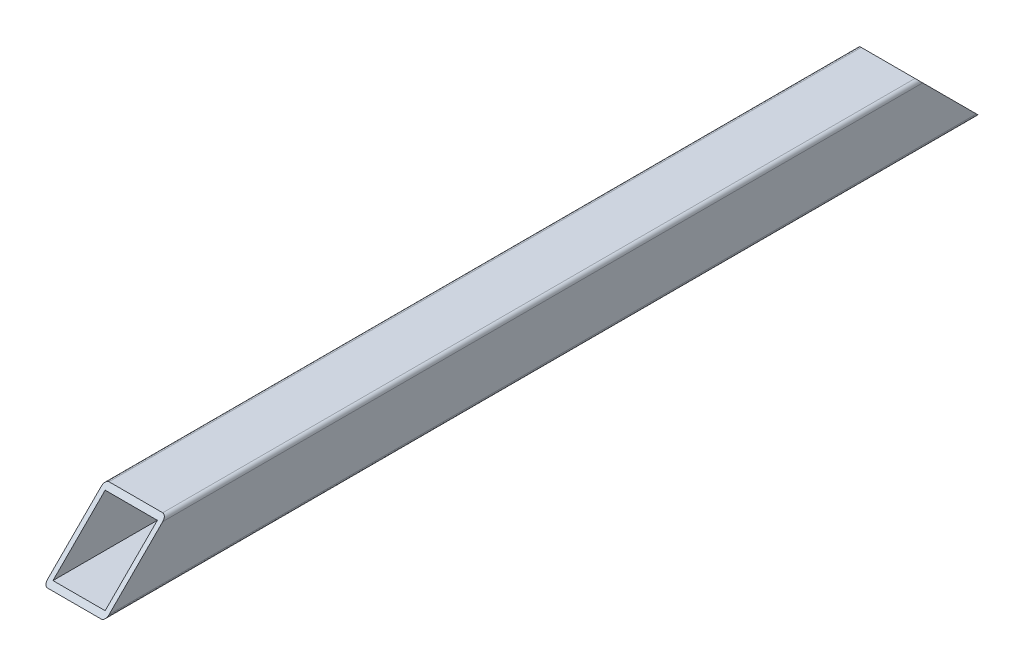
ISO-10303-21;
HEADER;
FILE_DESCRIPTION(('STEP AP214'),'2;1');
FILE_NAME('part.step','',(''),(''),'','','');
FILE_SCHEMA(('AUTOMOTIVE_DESIGN { 1 0 10303 214 1 1 1 1 }'));
ENDSEC;
DATA;
#1=APPLICATION_CONTEXT('core data for automotive mechanical design processes');
#2=APPLICATION_PROTOCOL_DEFINITION('international standard','automotive_design',2000,#1);
#3=PRODUCT_CONTEXT('',#1,'mechanical');
#4=PRODUCT('Part','Part','',(#3));
#5=PRODUCT_RELATED_PRODUCT_CATEGORY('part','',(#4));
#6=PRODUCT_DEFINITION_FORMATION('','',#4);
#7=PRODUCT_DEFINITION_CONTEXT('part definition',#1,'design');
#8=PRODUCT_DEFINITION('design','',#6,#7);
#9=PRODUCT_DEFINITION_SHAPE('','',#8);
#10=(LENGTH_UNIT() NAMED_UNIT(*) SI_UNIT(.MILLI.,.METRE.));
#11=(NAMED_UNIT(*) PLANE_ANGLE_UNIT() SI_UNIT($,.RADIAN.));
#12=(NAMED_UNIT(*) SI_UNIT($,.STERADIAN.) SOLID_ANGLE_UNIT());
#13=UNCERTAINTY_MEASURE_WITH_UNIT(LENGTH_MEASURE(1.E-05),#10,'distance_accuracy_value','');
#14=(GEOMETRIC_REPRESENTATION_CONTEXT(3) GLOBAL_UNCERTAINTY_ASSIGNED_CONTEXT((#13)) GLOBAL_UNIT_ASSIGNED_CONTEXT((#10,
#11,#12)) REPRESENTATION_CONTEXT('',''));
#15=CARTESIAN_POINT('',(0.,0.,0.));
#16=DIRECTION('',(0.,0.,1.));
#17=DIRECTION('',(1.,0.,0.));
#18=AXIS2_PLACEMENT_3D('',#15,#16,#17);
#19=CARTESIAN_POINT('',(0.,0.,1140.));
#20=DIRECTION('',(1.,0.,0.));
#21=DIRECTION('',(0.,1.,0.));
#22=AXIS2_PLACEMENT_3D('',#19,#20,#21);
#23=PLANE('',#22);
#24=DIRECTION('',(0.,-0.707106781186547,-0.707106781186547));
#25=VECTOR('',#24,1.);
#26=CARTESIAN_POINT('',(0.,0.,79.9999999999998));
#27=LINE('',#26,#25);
#28=CARTESIAN_POINT('',(-1.77635683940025E-12,-5.00000000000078,74.9999999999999));
#29=VERTEX_POINT('',#28);
#30=CARTESIAN_POINT('',(0.,-74.9999999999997,5.));
#31=VERTEX_POINT('',#30);
#32=EDGE_CURVE('E265',#29,#31,#27,.T.);
#33=ORIENTED_EDGE('',*,*,#32,.T.);
#34=DIRECTION('',(0.,0.,-0.999999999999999));
#35=VECTOR('',#34,1.);
#36=CARTESIAN_POINT('',(-1.77635683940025E-12,-75.0000000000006,1140.));
#37=LINE('',#36,#35);
#38=CARTESIAN_POINT('',(-1.77635683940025E-12,-75.0000000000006,1135.));
#39=VERTEX_POINT('',#38);
#40=EDGE_CURVE('E112',#31,#39,#37,.F.);
#41=ORIENTED_EDGE('',*,*,#40,.T.);
#42=DIRECTION('',(0.,0.707106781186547,-0.707106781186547));
#43=VECTOR('',#42,1.);
#44=CARTESIAN_POINT('',(0.,-80.0000000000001,1140.));
#45=LINE('',#44,#43);
#46=CARTESIAN_POINT('',(-1.77635683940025E-12,-5.00000000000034,1065.));
#47=VERTEX_POINT('',#46);
#48=EDGE_CURVE('E295',#39,#47,#45,.T.);
#49=ORIENTED_EDGE('',*,*,#48,.T.);
#50=DIRECTION('',(0.,0.,-0.999999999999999));
#51=VECTOR('',#50,1.);
#52=CARTESIAN_POINT('',(-1.77635683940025E-12,-5.00000000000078,1140.));
#53=LINE('',#52,#51);
#54=EDGE_CURVE('E245',#47,#29,#53,.T.);
#55=ORIENTED_EDGE('',*,*,#54,.T.);
#56=EDGE_LOOP('',(#33,#41,#49,#55));
#57=FACE_BOUND('',#56,.T.);
#58=ADVANCED_FACE('F91',(#57),#23,.F.);
#59=CARTESIAN_POINT('',(0.,-80.0000000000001,1140.));
#60=DIRECTION('',(0.,1.,0.));
#61=DIRECTION('',(0.,0.,0.999999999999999));
#62=AXIS2_PLACEMENT_3D('',#59,#60,#61);
#63=PLANE('',#62);
#64=DIRECTION('',(1.,0.,0.));
#65=VECTOR('',#64,1.);
#66=CARTESIAN_POINT('',(0.,-80.0000000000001,0.));
#67=LINE('',#66,#65);
#68=CARTESIAN_POINT('',(4.99999999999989,-80.0000000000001,0.));
#69=VERTEX_POINT('',#68);
#70=CARTESIAN_POINT('',(74.9999999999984,-80.0000000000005,0.));
#71=VERTEX_POINT('',#70);
#72=EDGE_CURVE('E214',#69,#71,#67,.T.);
#73=ORIENTED_EDGE('',*,*,#72,.T.);
#74=DIRECTION('',(0.,0.,-0.999999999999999));
#75=VECTOR('',#74,1.);
#76=CARTESIAN_POINT('',(75.0000000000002,-80.0000000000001,1140.));
#77=LINE('',#76,#75);
#78=CARTESIAN_POINT('',(75.0000000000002,-80.0000000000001,1140.));
#79=VERTEX_POINT('',#78);
#80=EDGE_CURVE('E236',#71,#79,#77,.F.);
#81=ORIENTED_EDGE('',*,*,#80,.T.);
#82=DIRECTION('',(1.,0.,0.));
#83=VECTOR('',#82,1.);
#84=CARTESIAN_POINT('',(0.,-80.0000000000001,1140.));
#85=LINE('',#84,#83);
#86=CARTESIAN_POINT('',(4.99999999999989,-80.0000000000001,1140.));
#87=VERTEX_POINT('',#86);
#88=EDGE_CURVE('E217',#87,#79,#85,.T.);
#89=ORIENTED_EDGE('',*,*,#88,.F.);
#90=DIRECTION('',(0.,0.,-0.999999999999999));
#91=VECTOR('',#90,1.);
#92=CARTESIAN_POINT('',(4.99999999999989,-80.0000000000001,1140.));
#93=LINE('',#92,#91);
#94=EDGE_CURVE('E233',#87,#69,#93,.T.);
#95=ORIENTED_EDGE('',*,*,#94,.T.);
#96=EDGE_LOOP('',(#73,#81,#89,#95));
#97=FACE_BOUND('',#96,.T.);
#98=ADVANCED_FACE('F314',(#97),#63,.F.);
#99=CARTESIAN_POINT('',(80.0000000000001,0.,1140.));
#100=DIRECTION('',(-1.,0.,0.));
#101=DIRECTION('',(0.,-1.,0.));
#102=AXIS2_PLACEMENT_3D('',#99,#100,#101);
#103=PLANE('',#102);
#104=DIRECTION('',(0.,0.707106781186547,-0.707106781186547));
#105=VECTOR('',#104,1.);
#106=CARTESIAN_POINT('',(80.0000000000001,-80.0000000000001,1140.));
#107=LINE('',#106,#105);
#108=CARTESIAN_POINT('',(79.9999999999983,-75.0000000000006,1135.));
#109=VERTEX_POINT('',#108);
#110=CARTESIAN_POINT('',(79.9999999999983,-5.00000000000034,1065.));
#111=VERTEX_POINT('',#110);
#112=EDGE_CURVE('E293',#109,#111,#107,.T.);
#113=ORIENTED_EDGE('',*,*,#112,.F.);
#114=DIRECTION('',(0.,0.,-0.999999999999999));
#115=VECTOR('',#114,1.);
#116=CARTESIAN_POINT('',(79.9999999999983,-75.0000000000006,1140.));
#117=LINE('',#116,#115);
#118=CARTESIAN_POINT('',(79.9999999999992,-75.0000000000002,5.));
#119=VERTEX_POINT('',#118);
#120=EDGE_CURVE('E222',#109,#119,#117,.T.);
#121=ORIENTED_EDGE('',*,*,#120,.T.);
#122=DIRECTION('',(0.,-0.707106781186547,-0.707106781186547));
#123=VECTOR('',#122,1.);
#124=CARTESIAN_POINT('',(80.0000000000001,0.,79.9999999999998));
#125=LINE('',#124,#123);
#126=CARTESIAN_POINT('',(79.9999999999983,-5.00000000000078,74.9999999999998));
#127=VERTEX_POINT('',#126);
#128=EDGE_CURVE('E269',#127,#119,#125,.T.);
#129=ORIENTED_EDGE('',*,*,#128,.F.);
#130=DIRECTION('',(0.,0.,-0.999999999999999));
#131=VECTOR('',#130,1.);
#132=CARTESIAN_POINT('',(79.9999999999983,-5.00000000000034,1140.));
#133=LINE('',#132,#131);
#134=EDGE_CURVE('E189',#127,#111,#133,.F.);
#135=ORIENTED_EDGE('',*,*,#134,.T.);
#136=EDGE_LOOP('',(#113,#121,#129,#135));
#137=FACE_BOUND('',#136,.T.);
#138=ADVANCED_FACE('F289',(#137),#103,.F.);
#139=CARTESIAN_POINT('',(0.,0.,1140.));
#140=DIRECTION('',(0.,-1.,0.));
#141=DIRECTION('',(0.,0.,-0.999999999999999));
#142=AXIS2_PLACEMENT_3D('',#139,#140,#141);
#143=PLANE('',#142);
#144=DIRECTION('',(1.,0.,0.));
#145=VECTOR('',#144,1.);
#146=CARTESIAN_POINT('',(0.,0.,79.9999999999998));
#147=LINE('',#146,#145);
#148=CARTESIAN_POINT('',(4.99999999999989,0.,79.9999999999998));
#149=VERTEX_POINT('',#148);
#150=CARTESIAN_POINT('',(74.9999999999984,-4.44089209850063E-13,79.9999999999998));
#151=VERTEX_POINT('',#150);
#152=EDGE_CURVE('E255',#149,#151,#147,.T.);
#153=ORIENTED_EDGE('',*,*,#152,.F.);
#154=DIRECTION('',(0.,0.,-0.999999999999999));
#155=VECTOR('',#154,1.);
#156=CARTESIAN_POINT('',(4.99999999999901,-4.44089209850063E-13,1140.));
#157=LINE('',#156,#155);
#158=CARTESIAN_POINT('',(4.99999999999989,0.,1060.));
#159=VERTEX_POINT('',#158);
#160=EDGE_CURVE('E14',#149,#159,#157,.F.);
#161=ORIENTED_EDGE('',*,*,#160,.T.);
#162=DIRECTION('',(1.,0.,0.));
#163=VECTOR('',#162,1.);
#164=CARTESIAN_POINT('',(0.,0.,1060.));
#165=LINE('',#164,#163);
#166=CARTESIAN_POINT('',(75.0000000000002,0.,1060.));
#167=VERTEX_POINT('',#166);
#168=EDGE_CURVE('E200',#159,#167,#165,.T.);
#169=ORIENTED_EDGE('',*,*,#168,.T.);
#170=DIRECTION('',(0.,0.,-0.999999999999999));
#171=VECTOR('',#170,1.);
#172=CARTESIAN_POINT('',(75.0000000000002,0.,1140.));
#173=LINE('',#172,#171);
#174=EDGE_CURVE('E98',#167,#151,#173,.T.);
#175=ORIENTED_EDGE('',*,*,#174,.T.);
#176=EDGE_LOOP('',(#153,#161,#169,#175));
#177=FACE_BOUND('',#176,.T.);
#178=ADVANCED_FACE('F254',(#177),#143,.F.);
#179=CARTESIAN_POINT('',(6.00000000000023,0.,1140.));
#180=DIRECTION('',(1.,0.,0.));
#181=DIRECTION('',(0.,1.,0.));
#182=AXIS2_PLACEMENT_3D('',#179,#180,#181);
#183=PLANE('',#182);
#184=DIRECTION('',(0.,0.707106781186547,-0.707106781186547));
#185=VECTOR('',#184,1.);
#186=CARTESIAN_POINT('',(6.00000000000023,-40.,1100.));
#187=LINE('',#186,#185);
#188=CARTESIAN_POINT('',(5.99999999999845,-74.0000000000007,1134.));
#189=VERTEX_POINT('',#188);
#190=CARTESIAN_POINT('',(6.00000000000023,-5.99999999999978,1066.));
#191=VERTEX_POINT('',#190);
#192=EDGE_CURVE('E185',#189,#191,#187,.T.);
#193=ORIENTED_EDGE('',*,*,#192,.F.);
#194=DIRECTION('',(0.,0.,-0.999999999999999));
#195=VECTOR('',#194,1.);
#196=CARTESIAN_POINT('',(5.99999999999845,-74.0000000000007,1140.));
#197=LINE('',#196,#195);
#198=CARTESIAN_POINT('',(5.99999999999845,-74.0000000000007,6.00000000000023));
#199=VERTEX_POINT('',#198);
#200=EDGE_CURVE('E207',#189,#199,#197,.T.);
#201=ORIENTED_EDGE('',*,*,#200,.T.);
#202=DIRECTION('',(0.,-0.707106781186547,-0.707106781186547));
#203=VECTOR('',#202,1.);
#204=CARTESIAN_POINT('',(5.99999999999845,529.999999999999,610.));
#205=LINE('',#204,#203);
#206=CARTESIAN_POINT('',(6.00000000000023,-5.99999999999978,74.));
#207=VERTEX_POINT('',#206);
#208=EDGE_CURVE('E209',#207,#199,#205,.T.);
#209=ORIENTED_EDGE('',*,*,#208,.F.);
#210=DIRECTION('',(0.,0.,-0.999999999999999));
#211=VECTOR('',#210,1.);
#212=CARTESIAN_POINT('',(6.00000000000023,-5.99999999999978,1140.));
#213=LINE('',#212,#211);
#214=EDGE_CURVE('E205',#191,#207,#213,.T.);
#215=ORIENTED_EDGE('',*,*,#214,.F.);
#216=EDGE_LOOP('',(#193,#201,#209,#215));
#217=FACE_BOUND('',#216,.T.);
#218=ADVANCED_FACE('F326',(#217),#183,.T.);
#219=CARTESIAN_POINT('',(0.,-74.0000000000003,1140.));
#220=DIRECTION('',(0.,1.,0.));
#221=DIRECTION('',(0.,0.,0.999999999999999));
#222=AXIS2_PLACEMENT_3D('',#219,#220,#221);
#223=PLANE('',#222);
#224=DIRECTION('',(-1.,0.,0.));
#225=VECTOR('',#224,1.);
#226=CARTESIAN_POINT('',(0.,-74.0000000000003,1134.));
#227=LINE('',#226,#225);
#228=CARTESIAN_POINT('',(73.9999999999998,-74.0000000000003,1134.));
#229=VERTEX_POINT('',#228);
#230=EDGE_CURVE('E199',#229,#189,#227,.T.);
#231=ORIENTED_EDGE('',*,*,#230,.F.);
#232=DIRECTION('',(0.,0.,-0.999999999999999));
#233=VECTOR('',#232,1.);
#234=CARTESIAN_POINT('',(73.9999999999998,-74.0000000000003,1140.));
#235=LINE('',#234,#233);
#236=CARTESIAN_POINT('',(73.9999999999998,-74.0000000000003,6.00000000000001));
#237=VERTEX_POINT('',#236);
#238=EDGE_CURVE('E198',#229,#237,#235,.T.);
#239=ORIENTED_EDGE('',*,*,#238,.T.);
#240=DIRECTION('',(1.,0.,0.));
#241=VECTOR('',#240,1.);
#242=CARTESIAN_POINT('',(-1.77635683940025E-12,-74.0000000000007,6.00000000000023));
#243=LINE('',#242,#241);
#244=EDGE_CURVE('E267',#199,#237,#243,.T.);
#245=ORIENTED_EDGE('',*,*,#244,.F.);
#246=ORIENTED_EDGE('',*,*,#200,.F.);
#247=EDGE_LOOP('',(#231,#239,#245,#246));
#248=FACE_BOUND('',#247,.T.);
#249=ADVANCED_FACE('F281',(#248),#223,.T.);
#250=CARTESIAN_POINT('',(73.9999999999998,0.,1140.));
#251=DIRECTION('',(-1.,0.,0.));
#252=DIRECTION('',(0.,-1.,0.));
#253=AXIS2_PLACEMENT_3D('',#250,#251,#252);
#254=PLANE('',#253);
#255=DIRECTION('',(0.,-0.707106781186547,0.707106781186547));
#256=VECTOR('',#255,1.);
#257=CARTESIAN_POINT('',(73.9999999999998,-40.,1100.));
#258=LINE('',#257,#256);
#259=CARTESIAN_POINT('',(73.9999999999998,-5.99999999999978,1066.));
#260=VERTEX_POINT('',#259);
#261=EDGE_CURVE('E182',#260,#229,#258,.T.);
#262=ORIENTED_EDGE('',*,*,#261,.F.);
#263=DIRECTION('',(0.,0.,-0.999999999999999));
#264=VECTOR('',#263,1.);
#265=CARTESIAN_POINT('',(73.9999999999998,-5.99999999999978,1140.));
#266=LINE('',#265,#264);
#267=CARTESIAN_POINT('',(73.9999999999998,-5.99999999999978,74.));
#268=VERTEX_POINT('',#267);
#269=EDGE_CURVE('E196',#260,#268,#266,.T.);
#270=ORIENTED_EDGE('',*,*,#269,.T.);
#271=DIRECTION('',(0.,0.707106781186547,0.707106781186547));
#272=VECTOR('',#271,1.);
#273=CARTESIAN_POINT('',(73.9999999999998,530.,610.));
#274=LINE('',#273,#272);
#275=EDGE_CURVE('E264',#237,#268,#274,.T.);
#276=ORIENTED_EDGE('',*,*,#275,.F.);
#277=ORIENTED_EDGE('',*,*,#238,.F.);
#278=EDGE_LOOP('',(#262,#270,#276,#277));
#279=FACE_BOUND('',#278,.T.);
#280=ADVANCED_FACE('F194',(#279),#254,.T.);
#281=CARTESIAN_POINT('',(0.,-5.99999999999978,1140.));
#282=DIRECTION('',(0.,-1.,0.));
#283=DIRECTION('',(0.,0.,-0.999999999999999));
#284=AXIS2_PLACEMENT_3D('',#281,#282,#283);
#285=PLANE('',#284);
#286=DIRECTION('',(1.,0.,0.));
#287=VECTOR('',#286,1.);
#288=CARTESIAN_POINT('',(0.,-5.99999999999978,1066.));
#289=LINE('',#288,#287);
#290=EDGE_CURVE('E179',#191,#260,#289,.T.);
#291=ORIENTED_EDGE('',*,*,#290,.F.);
#292=ORIENTED_EDGE('',*,*,#214,.T.);
#293=DIRECTION('',(-1.,0.,0.));
#294=VECTOR('',#293,1.);
#295=CARTESIAN_POINT('',(0.,-5.99999999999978,74.));
#296=LINE('',#295,#294);
#297=EDGE_CURVE('E190',#268,#207,#296,.T.);
#298=ORIENTED_EDGE('',*,*,#297,.F.);
#299=ORIENTED_EDGE('',*,*,#269,.F.);
#300=EDGE_LOOP('',(#291,#292,#298,#299));
#301=FACE_BOUND('',#300,.T.);
#302=ADVANCED_FACE('F203',(#301),#285,.T.);
#303=CARTESIAN_POINT('',(0.,0.,79.9999999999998));
#304=DIRECTION('',(0.,-0.707106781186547,0.707106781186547));
#305=DIRECTION('',(0.,-0.707106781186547,-0.707106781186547));
#306=AXIS2_PLACEMENT_3D('',#303,#304,#305);
#307=PLANE('',#306);
#308=ORIENTED_EDGE('',*,*,#208,.T.);
#309=ORIENTED_EDGE('',*,*,#244,.T.);
#310=ORIENTED_EDGE('',*,*,#275,.T.);
#311=ORIENTED_EDGE('',*,*,#297,.T.);
#312=EDGE_LOOP('',(#308,#309,#310,#311));
#313=FACE_BOUND('',#312,.T.);
#314=ORIENTED_EDGE('',*,*,#128,.T.);
#315=CARTESIAN_POINT('',(75.0000000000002,-74.9999999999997,5.00000000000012));
#316=DIRECTION('',(0.,-0.707106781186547,0.707106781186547));
#317=DIRECTION('',(0.,-0.707106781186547,-0.707106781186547));
#318=AXIS2_PLACEMENT_3D('',#315,#316,#317);
#319=ELLIPSE('',#318,7.07106781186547,5.);
#320=EDGE_CURVE('E231',#119,#71,#319,.F.);
#321=ORIENTED_EDGE('',*,*,#320,.T.);
#322=ORIENTED_EDGE('',*,*,#72,.F.);
#323=CARTESIAN_POINT('',(4.99999999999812,-75.0000000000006,5.00000000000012));
#324=DIRECTION('',(0.,-0.707106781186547,0.707106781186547));
#325=DIRECTION('',(0.,-0.707106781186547,-0.707106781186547));
#326=AXIS2_PLACEMENT_3D('',#323,#324,#325);
#327=ELLIPSE('',#326,7.07106781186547,5.);
#328=EDGE_CURVE('E229',#69,#31,#327,.F.);
#329=ORIENTED_EDGE('',*,*,#328,.T.);
#330=ORIENTED_EDGE('',*,*,#32,.F.);
#331=CARTESIAN_POINT('',(4.99999999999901,-5.00000000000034,75.0000000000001));
#332=DIRECTION('',(0.,-0.707106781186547,0.707106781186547));
#333=DIRECTION('',(0.,-0.707106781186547,-0.707106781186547));
#334=AXIS2_PLACEMENT_3D('',#331,#332,#333);
#335=ELLIPSE('',#334,7.07106781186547,5.);
#336=EDGE_CURVE('E227',#29,#149,#335,.F.);
#337=ORIENTED_EDGE('',*,*,#336,.T.);
#338=ORIENTED_EDGE('',*,*,#152,.T.);
#339=CARTESIAN_POINT('',(75.0000000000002,-4.99999999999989,75.0000000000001));
#340=DIRECTION('',(0.,-0.707106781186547,0.707106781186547));
#341=DIRECTION('',(0.,-0.707106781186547,-0.707106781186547));
#342=AXIS2_PLACEMENT_3D('',#339,#340,#341);
#343=ELLIPSE('',#342,7.07106781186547,5.);
#344=EDGE_CURVE('E225',#151,#127,#343,.F.);
#345=ORIENTED_EDGE('',*,*,#344,.T.);
#346=EDGE_LOOP('',(#314,#321,#322,#329,#330,#337,#338,#345));
#347=FACE_BOUND('',#346,.T.);
#348=ADVANCED_FACE('F261',(#313,#347),#307,.F.);
#349=CARTESIAN_POINT('',(0.,-80.0000000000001,1140.));
#350=DIRECTION('',(0.,-0.707106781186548,-0.707106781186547));
#351=DIRECTION('',(0.,0.707106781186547,-0.707106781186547));
#352=AXIS2_PLACEMENT_3D('',#349,#350,#351);
#353=PLANE('',#352);
#354=ORIENTED_EDGE('',*,*,#192,.T.);
#355=ORIENTED_EDGE('',*,*,#290,.T.);
#356=ORIENTED_EDGE('',*,*,#261,.T.);
#357=ORIENTED_EDGE('',*,*,#230,.T.);
#358=EDGE_LOOP('',(#354,#355,#356,#357));
#359=FACE_BOUND('',#358,.T.);
#360=ORIENTED_EDGE('',*,*,#88,.T.);
#361=CARTESIAN_POINT('',(74.9999999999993,-75.0000000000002,1135.));
#362=DIRECTION('',(0.,-0.707106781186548,-0.707106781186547));
#363=DIRECTION('',(0.,0.707106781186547,-0.707106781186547));
#364=AXIS2_PLACEMENT_3D('',#361,#362,#363);
#365=ELLIPSE('',#364,7.07106781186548,5.);
#366=EDGE_CURVE('E243',#79,#109,#365,.F.);
#367=ORIENTED_EDGE('',*,*,#366,.T.);
#368=ORIENTED_EDGE('',*,*,#112,.T.);
#369=CARTESIAN_POINT('',(74.9999999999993,-5.00000000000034,1065.));
#370=DIRECTION('',(0.,-0.707106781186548,-0.707106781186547));
#371=DIRECTION('',(0.,0.707106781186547,-0.707106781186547));
#372=AXIS2_PLACEMENT_3D('',#369,#370,#371);
#373=ELLIPSE('',#372,7.07106781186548,5.);
#374=EDGE_CURVE('E238',#111,#167,#373,.F.);
#375=ORIENTED_EDGE('',*,*,#374,.T.);
#376=ORIENTED_EDGE('',*,*,#168,.F.);
#377=CARTESIAN_POINT('',(4.99999999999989,-5.00000000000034,1065.));
#378=DIRECTION('',(0.,-0.707106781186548,-0.707106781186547));
#379=DIRECTION('',(0.,0.707106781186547,-0.707106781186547));
#380=AXIS2_PLACEMENT_3D('',#377,#378,#379);
#381=ELLIPSE('',#380,7.07106781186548,5.);
#382=EDGE_CURVE('E105',#159,#47,#381,.F.);
#383=ORIENTED_EDGE('',*,*,#382,.T.);
#384=ORIENTED_EDGE('',*,*,#48,.F.);
#385=CARTESIAN_POINT('',(4.99999999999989,-75.0000000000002,1135.));
#386=DIRECTION('',(0.,-0.707106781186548,-0.707106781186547));
#387=DIRECTION('',(0.,0.707106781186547,-0.707106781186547));
#388=AXIS2_PLACEMENT_3D('',#385,#386,#387);
#389=ELLIPSE('',#388,7.07106781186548,5.);
#390=EDGE_CURVE('E241',#39,#87,#389,.F.);
#391=ORIENTED_EDGE('',*,*,#390,.T.);
#392=EDGE_LOOP('',(#360,#367,#368,#375,#376,#383,#384,#391));
#393=FACE_BOUND('',#392,.T.);
#394=ADVANCED_FACE('F181',(#359,#393),#353,.F.);
#395=CARTESIAN_POINT('',(74.9999999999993,-75.0000000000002,1140.));
#396=DIRECTION('',(0.,0.,-0.999999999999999));
#397=DIRECTION('',(-1.,0.,0.));
#398=AXIS2_PLACEMENT_3D('',#395,#396,#397);
#399=CYLINDRICAL_SURFACE('',#398,5.);
#400=ORIENTED_EDGE('',*,*,#366,.F.);
#401=ORIENTED_EDGE('',*,*,#80,.F.);
#402=ORIENTED_EDGE('',*,*,#320,.F.);
#403=ORIENTED_EDGE('',*,*,#120,.F.);
#404=EDGE_LOOP('',(#400,#401,#402,#403));
#405=FACE_BOUND('',#404,.T.);
#406=ADVANCED_FACE('F310',(#405),#399,.T.);
#407=CARTESIAN_POINT('',(4.99999999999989,-75.0000000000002,1140.));
#408=DIRECTION('',(0.,0.,-0.999999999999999));
#409=DIRECTION('',(-1.,0.,0.));
#410=AXIS2_PLACEMENT_3D('',#407,#408,#409);
#411=CYLINDRICAL_SURFACE('',#410,5.);
#412=ORIENTED_EDGE('',*,*,#390,.F.);
#413=ORIENTED_EDGE('',*,*,#40,.F.);
#414=ORIENTED_EDGE('',*,*,#328,.F.);
#415=ORIENTED_EDGE('',*,*,#94,.F.);
#416=EDGE_LOOP('',(#412,#413,#414,#415));
#417=FACE_BOUND('',#416,.T.);
#418=ADVANCED_FACE('F303',(#417),#411,.T.);
#419=CARTESIAN_POINT('',(4.99999999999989,-4.99999999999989,1140.));
#420=DIRECTION('',(0.,0.,-0.999999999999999));
#421=DIRECTION('',(-1.,0.,0.));
#422=AXIS2_PLACEMENT_3D('',#419,#420,#421);
#423=CYLINDRICAL_SURFACE('',#422,5.);
#424=ORIENTED_EDGE('',*,*,#382,.F.);
#425=ORIENTED_EDGE('',*,*,#160,.F.);
#426=ORIENTED_EDGE('',*,*,#336,.F.);
#427=ORIENTED_EDGE('',*,*,#54,.F.);
#428=EDGE_LOOP('',(#424,#425,#426,#427));
#429=FACE_BOUND('',#428,.T.);
#430=ADVANCED_FACE('F301',(#429),#423,.T.);
#431=CARTESIAN_POINT('',(74.9999999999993,-5.00000000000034,1140.));
#432=DIRECTION('',(0.,0.,-0.999999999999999));
#433=DIRECTION('',(-1.,0.,0.));
#434=AXIS2_PLACEMENT_3D('',#431,#432,#433);
#435=CYLINDRICAL_SURFACE('',#434,5.);
#436=ORIENTED_EDGE('',*,*,#374,.F.);
#437=ORIENTED_EDGE('',*,*,#134,.F.);
#438=ORIENTED_EDGE('',*,*,#344,.F.);
#439=ORIENTED_EDGE('',*,*,#174,.F.);
#440=EDGE_LOOP('',(#436,#437,#438,#439));
#441=FACE_BOUND('',#440,.T.);
#442=ADVANCED_FACE('F292',(#441),#435,.T.);
#443=CLOSED_SHELL('',(#58,#98,#138,#178,#218,#249,#280,#302,#348,#394,#406,#418,#430,#442));
#444=MANIFOLD_SOLID_BREP('B2',#443);
#445=ADVANCED_BREP_SHAPE_REPRESENTATION('',(#18,#444),#14);
#446=SHAPE_DEFINITION_REPRESENTATION(#9,#445);
ENDSEC;
END-ISO-10303-21;
